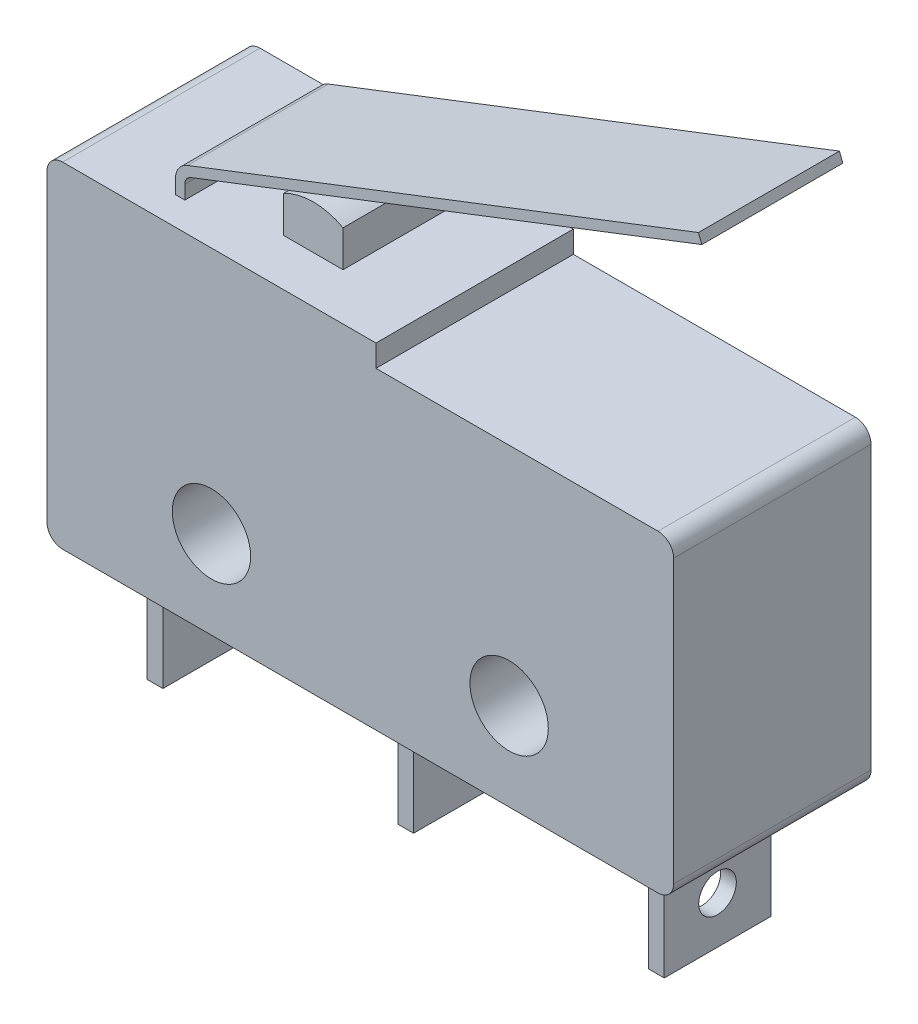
ISO-10303-21;
HEADER;
FILE_DESCRIPTION(('STEP AP214'),'2;1');
FILE_NAME('part.step','',(''),(''),'','','');
FILE_SCHEMA(('AUTOMOTIVE_DESIGN { 1 0 10303 214 1 1 1 1 }'));
ENDSEC;
DATA;
#1=APPLICATION_CONTEXT('core data for automotive mechanical design processes');
#2=APPLICATION_PROTOCOL_DEFINITION('international standard','automotive_design',2000,#1);
#3=PRODUCT_CONTEXT('',#1,'mechanical');
#4=PRODUCT('Part','Part','',(#3));
#5=PRODUCT_RELATED_PRODUCT_CATEGORY('part','',(#4));
#6=PRODUCT_DEFINITION_FORMATION('','',#4);
#7=PRODUCT_DEFINITION_CONTEXT('part definition',#1,'design');
#8=PRODUCT_DEFINITION('design','',#6,#7);
#9=PRODUCT_DEFINITION_SHAPE('','',#8);
#10=(LENGTH_UNIT() NAMED_UNIT(*) SI_UNIT(.MILLI.,.METRE.));
#11=(NAMED_UNIT(*) PLANE_ANGLE_UNIT() SI_UNIT($,.RADIAN.));
#12=(NAMED_UNIT(*) SI_UNIT($,.STERADIAN.) SOLID_ANGLE_UNIT());
#13=UNCERTAINTY_MEASURE_WITH_UNIT(LENGTH_MEASURE(1.E-05),#10,'distance_accuracy_value','');
#14=(GEOMETRIC_REPRESENTATION_CONTEXT(3) GLOBAL_UNCERTAINTY_ASSIGNED_CONTEXT((#13)) GLOBAL_UNIT_ASSIGNED_CONTEXT((#10,
#11,#12)) REPRESENTATION_CONTEXT('',''));
#15=CARTESIAN_POINT('',(0.,0.,0.));
#16=DIRECTION('',(0.,0.,1.));
#17=DIRECTION('',(1.,0.,0.));
#18=AXIS2_PLACEMENT_3D('',#15,#16,#17);
#19=CARTESIAN_POINT('',(0.,0.,2.25));
#20=DIRECTION('',(0.,0.,1.));
#21=DIRECTION('',(1.,0.,0.));
#22=AXIS2_PLACEMENT_3D('',#19,#20,#21);
#23=PLANE('',#22);
#24=DIRECTION('',(0.,1.,0.));
#25=VECTOR('',#24,1.);
#26=CARTESIAN_POINT('',(-6.8,0.,2.25));
#27=LINE('',#26,#25);
#28=CARTESIAN_POINT('',(-6.8,5.790311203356,2.25));
#29=VERTEX_POINT('',#28);
#30=CARTESIAN_POINT('',(-6.8,5.35,2.25));
#31=VERTEX_POINT('',#30);
#32=EDGE_CURVE('E227',#29,#31,#27,.F.);
#33=ORIENTED_EDGE('',*,*,#32,.T.);
#34=DIRECTION('',(1.,0.,0.));
#35=VECTOR('',#34,1.);
#36=CARTESIAN_POINT('',(0.,5.35,2.25));
#37=LINE('',#36,#35);
#38=CARTESIAN_POINT('',(-6.5,5.35,2.25));
#39=VERTEX_POINT('',#38);
#40=EDGE_CURVE('E202',#31,#39,#37,.T.);
#41=ORIENTED_EDGE('',*,*,#40,.T.);
#42=DIRECTION('',(0.,1.,0.));
#43=VECTOR('',#42,1.);
#44=CARTESIAN_POINT('',(-6.5,0.,2.25));
#45=LINE('',#44,#43);
#46=CARTESIAN_POINT('',(-6.5,5.790311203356,2.25));
#47=VERTEX_POINT('',#46);
#48=EDGE_CURVE('E196',#39,#47,#45,.T.);
#49=ORIENTED_EDGE('',*,*,#48,.T.);
#50=CARTESIAN_POINT('',(-6.2,5.790311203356,2.25));
#51=DIRECTION('',(0.,0.,1.));
#52=DIRECTION('',(1.,0.,0.));
#53=AXIS2_PLACEMENT_3D('',#50,#51,#52);
#54=CIRCLE('',#53,0.3);
#55=CARTESIAN_POINT('',(-6.30810695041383,6.07015560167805,2.25));
#56=VERTEX_POINT('',#55);
#57=EDGE_CURVE('E20',#47,#56,#54,.F.);
#58=ORIENTED_EDGE('',*,*,#57,.T.);
#59=DIRECTION('',(0.932814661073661,0.360356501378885,0.));
#60=VECTOR('',#59,1.);
#61=CARTESIAN_POINT('',(-6.308106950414,6.070155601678,2.25));
#62=LINE('',#61,#60);
#63=CARTESIAN_POINT('',(10.0000000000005,12.3701556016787,2.25));
#64=VERTEX_POINT('',#63);
#65=EDGE_CURVE('E355',#64,#56,#62,.F.);
#66=ORIENTED_EDGE('',*,*,#65,.F.);
#67=DIRECTION('',(-0.360356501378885,0.932814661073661,0.));
#68=VECTOR('',#67,1.);
#69=CARTESIAN_POINT('',(10.,12.37015560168,2.25));
#70=LINE('',#69,#68);
#71=CARTESIAN_POINT('',(9.89189304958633,12.6500000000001,2.25));
#72=VERTEX_POINT('',#71);
#73=EDGE_CURVE('E332',#72,#64,#70,.F.);
#74=ORIENTED_EDGE('',*,*,#73,.F.);
#75=DIRECTION('',(-0.932814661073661,-0.360356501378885,0.));
#76=VECTOR('',#75,1.);
#77=CARTESIAN_POINT('',(9.891893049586,12.65,2.25));
#78=LINE('',#77,#76);
#79=CARTESIAN_POINT('',(-6.41621390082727,6.35000000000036,2.25));
#80=VERTEX_POINT('',#79);
#81=EDGE_CURVE('E373',#80,#72,#78,.F.);
#82=ORIENTED_EDGE('',*,*,#81,.F.);
#83=CARTESIAN_POINT('',(-6.2,5.790311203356,2.25));
#84=DIRECTION('',(0.,0.,1.));
#85=DIRECTION('',(1.,0.,0.));
#86=AXIS2_PLACEMENT_3D('',#83,#84,#85);
#87=CIRCLE('',#86,0.6);
#88=EDGE_CURVE('E223',#80,#29,#87,.T.);
#89=ORIENTED_EDGE('',*,*,#88,.T.);
#90=EDGE_LOOP('',(#33,#41,#49,#58,#66,#74,#82,#89));
#91=FACE_BOUND('',#90,.T.);
#92=ADVANCED_FACE('F17',(#91),#23,.T.);
#93=CARTESIAN_POINT('',(10.,12.37015560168,-2.25));
#94=DIRECTION('',(0.932814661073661,0.360356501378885,0.));
#95=DIRECTION('',(-0.360356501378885,0.932814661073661,0.));
#96=AXIS2_PLACEMENT_3D('',#93,#94,#95);
#97=PLANE('',#96);
#98=DIRECTION('',(0.,0.,1.));
#99=VECTOR('',#98,1.);
#100=CARTESIAN_POINT('',(10.0000000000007,12.3701556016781,-2.25));
#101=LINE('',#100,#99);
#102=CARTESIAN_POINT('',(10.0000000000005,12.3701556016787,-2.25));
#103=VERTEX_POINT('',#102);
#104=EDGE_CURVE('E359',#103,#64,#101,.T.);
#105=ORIENTED_EDGE('',*,*,#104,.F.);
#106=DIRECTION('',(-0.360356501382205,0.932814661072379,0.));
#107=VECTOR('',#106,1.);
#108=CARTESIAN_POINT('',(10.,12.37015560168,-2.25));
#109=LINE('',#108,#107);
#110=CARTESIAN_POINT('',(9.891893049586,12.65,-2.25));
#111=VERTEX_POINT('',#110);
#112=EDGE_CURVE('E236',#103,#111,#109,.T.);
#113=ORIENTED_EDGE('',*,*,#112,.T.);
#114=DIRECTION('',(0.,0.,1.));
#115=VECTOR('',#114,1.);
#116=CARTESIAN_POINT('',(9.891893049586,12.65,-2.25));
#117=LINE('',#116,#115);
#118=EDGE_CURVE('E382',#72,#111,#117,.F.);
#119=ORIENTED_EDGE('',*,*,#118,.F.);
#120=ORIENTED_EDGE('',*,*,#73,.T.);
#121=EDGE_LOOP('',(#105,#113,#119,#120));
#122=FACE_BOUND('',#121,.T.);
#123=ADVANCED_FACE('F1098',(#122),#97,.T.);
#124=CARTESIAN_POINT('',(0.,0.,-2.25));
#125=DIRECTION('',(0.,0.,1.));
#126=DIRECTION('',(1.,0.,0.));
#127=AXIS2_PLACEMENT_3D('',#124,#125,#126);
#128=PLANE('',#127);
#129=CARTESIAN_POINT('',(-6.2,5.790311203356,-2.25));
#130=DIRECTION('',(0.,0.,1.));
#131=DIRECTION('',(1.,0.,0.));
#132=AXIS2_PLACEMENT_3D('',#129,#130,#131);
#133=CIRCLE('',#132,0.6);
#134=CARTESIAN_POINT('',(-6.41621390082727,6.35000000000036,-2.25));
#135=VERTEX_POINT('',#134);
#136=CARTESIAN_POINT('',(-6.8,5.790311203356,-2.25));
#137=VERTEX_POINT('',#136);
#138=EDGE_CURVE('E237',#135,#137,#133,.T.);
#139=ORIENTED_EDGE('',*,*,#138,.F.);
#140=DIRECTION('',(-0.932814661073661,-0.360356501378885,0.));
#141=VECTOR('',#140,1.);
#142=CARTESIAN_POINT('',(9.891893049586,12.65,-2.25));
#143=LINE('',#142,#141);
#144=EDGE_CURVE('E391',#111,#135,#143,.T.);
#145=ORIENTED_EDGE('',*,*,#144,.F.);
#146=ORIENTED_EDGE('',*,*,#112,.F.);
#147=DIRECTION('',(0.932814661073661,0.360356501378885,0.));
#148=VECTOR('',#147,1.);
#149=CARTESIAN_POINT('',(-6.308106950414,6.070155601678,-2.25));
#150=LINE('',#149,#148);
#151=CARTESIAN_POINT('',(-6.30810695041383,6.07015560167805,-2.25));
#152=VERTEX_POINT('',#151);
#153=EDGE_CURVE('E358',#152,#103,#150,.T.);
#154=ORIENTED_EDGE('',*,*,#153,.F.);
#155=CARTESIAN_POINT('',(-6.2,5.790311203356,-2.25));
#156=DIRECTION('',(0.,0.,1.));
#157=DIRECTION('',(1.,0.,0.));
#158=AXIS2_PLACEMENT_3D('',#155,#156,#157);
#159=CIRCLE('',#158,0.3);
#160=CARTESIAN_POINT('',(-6.5,5.790311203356,-2.25));
#161=VERTEX_POINT('',#160);
#162=EDGE_CURVE('E233',#161,#152,#159,.F.);
#163=ORIENTED_EDGE('',*,*,#162,.F.);
#164=DIRECTION('',(0.,1.,0.));
#165=VECTOR('',#164,1.);
#166=CARTESIAN_POINT('',(-6.5,0.,-2.25));
#167=LINE('',#166,#165);
#168=CARTESIAN_POINT('',(-6.5,5.35,-2.25));
#169=VERTEX_POINT('',#168);
#170=EDGE_CURVE('E212',#169,#161,#167,.T.);
#171=ORIENTED_EDGE('',*,*,#170,.F.);
#172=DIRECTION('',(1.,0.,0.));
#173=VECTOR('',#172,1.);
#174=CARTESIAN_POINT('',(0.,5.35,-2.25));
#175=LINE('',#174,#173);
#176=CARTESIAN_POINT('',(-6.8,5.35,-2.25));
#177=VERTEX_POINT('',#176);
#178=EDGE_CURVE('E341',#177,#169,#175,.T.);
#179=ORIENTED_EDGE('',*,*,#178,.F.);
#180=DIRECTION('',(0.,1.,0.));
#181=VECTOR('',#180,1.);
#182=CARTESIAN_POINT('',(-6.8,0.,-2.25));
#183=LINE('',#182,#181);
#184=EDGE_CURVE('E241',#137,#177,#183,.F.);
#185=ORIENTED_EDGE('',*,*,#184,.F.);
#186=EDGE_LOOP('',(#139,#145,#146,#154,#163,#171,#179,#185));
#187=FACE_BOUND('',#186,.T.);
#188=ADVANCED_FACE('F831',(#187),#128,.F.);
#189=CARTESIAN_POINT('',(-6.308106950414,6.070155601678,-2.25));
#190=DIRECTION('',(0.360356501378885,-0.932814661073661,0.));
#191=DIRECTION('',(0.932814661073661,0.360356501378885,0.));
#192=AXIS2_PLACEMENT_3D('',#189,#190,#191);
#193=PLANE('',#192);
#194=DIRECTION('',(0.,0.,1.));
#195=VECTOR('',#194,1.);
#196=CARTESIAN_POINT('',(-6.30810695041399,6.07015560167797,-2.25));
#197=LINE('',#196,#195);
#198=EDGE_CURVE('E221',#56,#152,#197,.F.);
#199=ORIENTED_EDGE('',*,*,#198,.T.);
#200=ORIENTED_EDGE('',*,*,#153,.T.);
#201=ORIENTED_EDGE('',*,*,#104,.T.);
#202=ORIENTED_EDGE('',*,*,#65,.T.);
#203=EDGE_LOOP('',(#199,#200,#201,#202));
#204=FACE_BOUND('',#203,.T.);
#205=ADVANCED_FACE('F827',(#204),#193,.T.);
#206=CARTESIAN_POINT('',(9.891893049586,12.65,-2.25));
#207=DIRECTION('',(-0.360356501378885,0.932814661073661,0.));
#208=DIRECTION('',(-0.932814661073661,-0.360356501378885,0.));
#209=AXIS2_PLACEMENT_3D('',#206,#207,#208);
#210=PLANE('',#209);
#211=ORIENTED_EDGE('',*,*,#118,.T.);
#212=ORIENTED_EDGE('',*,*,#144,.T.);
#213=DIRECTION('',(0.,0.,1.));
#214=VECTOR('',#213,1.);
#215=CARTESIAN_POINT('',(-6.41621390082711,6.35000000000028,-2.25));
#216=LINE('',#215,#214);
#217=EDGE_CURVE('E246',#80,#135,#216,.F.);
#218=ORIENTED_EDGE('',*,*,#217,.F.);
#219=ORIENTED_EDGE('',*,*,#81,.T.);
#220=EDGE_LOOP('',(#211,#212,#218,#219));
#221=FACE_BOUND('',#220,.T.);
#222=ADVANCED_FACE('F830',(#221),#210,.T.);
#223=CARTESIAN_POINT('',(-8.25,-5.35,-1.7));
#224=DIRECTION('',(0.,0.,-1.));
#225=DIRECTION('',(-1.,0.,0.));
#226=AXIS2_PLACEMENT_3D('',#223,#224,#225);
#227=PLANE('',#226);
#228=DIRECTION('',(0.,1.,0.));
#229=VECTOR('',#228,1.);
#230=CARTESIAN_POINT('',(-8.25,-5.35,-1.7));
#231=LINE('',#230,#229);
#232=CARTESIAN_POINT('',(-8.25,-5.35,-1.7));
#233=VERTEX_POINT('',#232);
#234=CARTESIAN_POINT('',(-8.25,-9.05,-1.7));
#235=VERTEX_POINT('',#234);
#236=EDGE_CURVE('E251',#233,#235,#231,.F.);
#237=ORIENTED_EDGE('',*,*,#236,.F.);
#238=DIRECTION('',(-1.,0.,0.));
#239=VECTOR('',#238,1.);
#240=CARTESIAN_POINT('',(-8.25,-5.35,-1.7));
#241=LINE('',#240,#239);
#242=CARTESIAN_POINT('',(-7.75,-5.35,-1.7));
#243=VERTEX_POINT('',#242);
#244=EDGE_CURVE('E402',#233,#243,#241,.F.);
#245=ORIENTED_EDGE('',*,*,#244,.T.);
#246=DIRECTION('',(0.,1.,0.));
#247=VECTOR('',#246,1.);
#248=CARTESIAN_POINT('',(-7.75,-5.35,-1.7));
#249=LINE('',#248,#247);
#250=CARTESIAN_POINT('',(-7.75,-9.05,-1.7));
#251=VERTEX_POINT('',#250);
#252=EDGE_CURVE('E252',#251,#243,#249,.T.);
#253=ORIENTED_EDGE('',*,*,#252,.F.);
#254=DIRECTION('',(1.,0.,0.));
#255=VECTOR('',#254,1.);
#256=CARTESIAN_POINT('',(0.,-9.05,-1.7));
#257=LINE('',#256,#255);
#258=EDGE_CURVE('E418',#235,#251,#257,.T.);
#259=ORIENTED_EDGE('',*,*,#258,.F.);
#260=EDGE_LOOP('',(#237,#245,#253,#259));
#261=FACE_BOUND('',#260,.T.);
#262=ADVANCED_FACE('F841',(#261),#227,.T.);
#263=CARTESIAN_POINT('',(0.,-9.05,0.));
#264=DIRECTION('',(0.,-1.,0.));
#265=DIRECTION('',(0.,0.,-1.));
#266=AXIS2_PLACEMENT_3D('',#263,#264,#265);
#267=PLANE('',#266);
#268=DIRECTION('',(1.,0.,0.));
#269=VECTOR('',#268,1.);
#270=CARTESIAN_POINT('',(-7.75,-9.05,1.7));
#271=LINE('',#270,#269);
#272=CARTESIAN_POINT('',(-8.25,-9.05,1.7));
#273=VERTEX_POINT('',#272);
#274=CARTESIAN_POINT('',(-7.75,-9.05,1.7));
#275=VERTEX_POINT('',#274);
#276=EDGE_CURVE('E422',#273,#275,#271,.T.);
#277=ORIENTED_EDGE('',*,*,#276,.F.);
#278=DIRECTION('',(0.,0.,1.));
#279=VECTOR('',#278,1.);
#280=CARTESIAN_POINT('',(-8.25,-9.05,1.7));
#281=LINE('',#280,#279);
#282=EDGE_CURVE('E520',#235,#273,#281,.T.);
#283=ORIENTED_EDGE('',*,*,#282,.F.);
#284=ORIENTED_EDGE('',*,*,#258,.T.);
#285=DIRECTION('',(0.,0.,-1.));
#286=VECTOR('',#285,1.);
#287=CARTESIAN_POINT('',(-7.75,-9.05,-1.7));
#288=LINE('',#287,#286);
#289=EDGE_CURVE('E510',#275,#251,#288,.T.);
#290=ORIENTED_EDGE('',*,*,#289,.F.);
#291=EDGE_LOOP('',(#277,#283,#284,#290));
#292=FACE_BOUND('',#291,.T.);
#293=ADVANCED_FACE('F965',(#292),#267,.T.);
#294=CARTESIAN_POINT('',(-7.75,-5.35,1.7));
#295=DIRECTION('',(0.,0.,1.));
#296=DIRECTION('',(1.,0.,0.));
#297=AXIS2_PLACEMENT_3D('',#294,#295,#296);
#298=PLANE('',#297);
#299=DIRECTION('',(0.,1.,0.));
#300=VECTOR('',#299,1.);
#301=CARTESIAN_POINT('',(-7.75,-5.35,1.7));
#302=LINE('',#301,#300);
#303=CARTESIAN_POINT('',(-7.75,-5.35,1.7));
#304=VERTEX_POINT('',#303);
#305=EDGE_CURVE('E245',#304,#275,#302,.F.);
#306=ORIENTED_EDGE('',*,*,#305,.F.);
#307=DIRECTION('',(1.,0.,0.));
#308=VECTOR('',#307,1.);
#309=CARTESIAN_POINT('',(-7.75,-5.35,1.7));
#310=LINE('',#309,#308);
#311=CARTESIAN_POINT('',(-8.25,-5.35,1.7));
#312=VERTEX_POINT('',#311);
#313=EDGE_CURVE('E426',#304,#312,#310,.F.);
#314=ORIENTED_EDGE('',*,*,#313,.T.);
#315=DIRECTION('',(0.,1.,0.));
#316=VECTOR('',#315,1.);
#317=CARTESIAN_POINT('',(-8.25,-5.35,1.7));
#318=LINE('',#317,#316);
#319=EDGE_CURVE('E258',#273,#312,#318,.T.);
#320=ORIENTED_EDGE('',*,*,#319,.F.);
#321=ORIENTED_EDGE('',*,*,#276,.T.);
#322=EDGE_LOOP('',(#306,#314,#320,#321));
#323=FACE_BOUND('',#322,.T.);
#324=ADVANCED_FACE('F969',(#323),#298,.T.);
#325=CARTESIAN_POINT('',(-8.25,-7.55,0.));
#326=DIRECTION('',(-1.,0.,0.));
#327=DIRECTION('',(0.,0.,1.));
#328=AXIS2_PLACEMENT_3D('',#325,#326,#327);
#329=CYLINDRICAL_SURFACE('',#328,0.6);
#330=CARTESIAN_POINT('',(-7.75,-7.55,0.));
#331=DIRECTION('',(-1.,0.,0.));
#332=DIRECTION('',(0.,0.,1.));
#333=AXIS2_PLACEMENT_3D('',#330,#331,#332);
#334=CIRCLE('',#333,0.6);
#335=CARTESIAN_POINT('',(-7.75,-7.55,0.6));
#336=VERTEX_POINT('',#335);
#337=EDGE_CURVE('E247',#336,#336,#334,.T.);
#338=ORIENTED_EDGE('',*,*,#337,.F.);
#339=EDGE_LOOP('',(#338));
#340=FACE_BOUND('',#339,.T.);
#341=CARTESIAN_POINT('',(-8.25,-7.55,0.));
#342=DIRECTION('',(-1.,0.,0.));
#343=DIRECTION('',(0.,0.,1.));
#344=AXIS2_PLACEMENT_3D('',#341,#342,#343);
#345=CIRCLE('',#344,0.6);
#346=CARTESIAN_POINT('',(-8.25,-7.55,0.6));
#347=VERTEX_POINT('',#346);
#348=EDGE_CURVE('E253',#347,#347,#345,.F.);
#349=ORIENTED_EDGE('',*,*,#348,.F.);
#350=EDGE_LOOP('',(#349));
#351=FACE_BOUND('',#350,.T.);
#352=ADVANCED_FACE('F890',(#340,#351),#329,.F.);
#353=CARTESIAN_POINT('',(-0.25,-5.35,-1.7));
#354=DIRECTION('',(0.,0.,-1.));
#355=DIRECTION('',(-1.,0.,0.));
#356=AXIS2_PLACEMENT_3D('',#353,#354,#355);
#357=PLANE('',#356);
#358=DIRECTION('',(0.,1.,0.));
#359=VECTOR('',#358,1.);
#360=CARTESIAN_POINT('',(-0.25,-5.35,-1.7));
#361=LINE('',#360,#359);
#362=CARTESIAN_POINT('',(-0.25,-5.35,-1.7));
#363=VERTEX_POINT('',#362);
#364=CARTESIAN_POINT('',(-0.25,-9.05,-1.7));
#365=VERTEX_POINT('',#364);
#366=EDGE_CURVE('E263',#363,#365,#361,.F.);
#367=ORIENTED_EDGE('',*,*,#366,.F.);
#368=DIRECTION('',(-1.,0.,0.));
#369=VECTOR('',#368,1.);
#370=CARTESIAN_POINT('',(-0.25,-5.35,-1.7));
#371=LINE('',#370,#369);
#372=CARTESIAN_POINT('',(0.25,-5.35,-1.7));
#373=VERTEX_POINT('',#372);
#374=EDGE_CURVE('E430',#363,#373,#371,.F.);
#375=ORIENTED_EDGE('',*,*,#374,.T.);
#376=DIRECTION('',(0.,1.,0.));
#377=VECTOR('',#376,1.);
#378=CARTESIAN_POINT('',(0.25,-5.35,-1.7));
#379=LINE('',#378,#377);
#380=CARTESIAN_POINT('',(0.25,-9.05,-1.7));
#381=VERTEX_POINT('',#380);
#382=EDGE_CURVE('E264',#381,#373,#379,.T.);
#383=ORIENTED_EDGE('',*,*,#382,.F.);
#384=DIRECTION('',(1.,0.,0.));
#385=VECTOR('',#384,1.);
#386=CARTESIAN_POINT('',(0.,-9.05,-1.7));
#387=LINE('',#386,#385);
#388=EDGE_CURVE('E434',#365,#381,#387,.T.);
#389=ORIENTED_EDGE('',*,*,#388,.F.);
#390=EDGE_LOOP('',(#367,#375,#383,#389));
#391=FACE_BOUND('',#390,.T.);
#392=ADVANCED_FACE('F868',(#391),#357,.T.);
#393=CARTESIAN_POINT('',(0.,-9.05,0.));
#394=DIRECTION('',(0.,-1.,0.));
#395=DIRECTION('',(0.,0.,-1.));
#396=AXIS2_PLACEMENT_3D('',#393,#394,#395);
#397=PLANE('',#396);
#398=DIRECTION('',(1.,0.,0.));
#399=VECTOR('',#398,1.);
#400=CARTESIAN_POINT('',(0.25,-9.05,1.7));
#401=LINE('',#400,#399);
#402=CARTESIAN_POINT('',(-0.25,-9.05,1.7));
#403=VERTEX_POINT('',#402);
#404=CARTESIAN_POINT('',(0.25,-9.05,1.7));
#405=VERTEX_POINT('',#404);
#406=EDGE_CURVE('E438',#403,#405,#401,.T.);
#407=ORIENTED_EDGE('',*,*,#406,.F.);
#408=DIRECTION('',(0.,0.,1.));
#409=VECTOR('',#408,1.);
#410=CARTESIAN_POINT('',(-0.25,-9.05,1.7));
#411=LINE('',#410,#409);
#412=EDGE_CURVE('E540',#365,#403,#411,.T.);
#413=ORIENTED_EDGE('',*,*,#412,.F.);
#414=ORIENTED_EDGE('',*,*,#388,.T.);
#415=DIRECTION('',(0.,0.,-1.));
#416=VECTOR('',#415,1.);
#417=CARTESIAN_POINT('',(0.25,-9.05,-1.7));
#418=LINE('',#417,#416);
#419=EDGE_CURVE('E530',#405,#381,#418,.T.);
#420=ORIENTED_EDGE('',*,*,#419,.F.);
#421=EDGE_LOOP('',(#407,#413,#414,#420));
#422=FACE_BOUND('',#421,.T.);
#423=ADVANCED_FACE('F863',(#422),#397,.T.);
#424=CARTESIAN_POINT('',(0.25,-5.35,1.7));
#425=DIRECTION('',(0.,0.,1.));
#426=DIRECTION('',(1.,0.,0.));
#427=AXIS2_PLACEMENT_3D('',#424,#425,#426);
#428=PLANE('',#427);
#429=DIRECTION('',(0.,1.,0.));
#430=VECTOR('',#429,1.);
#431=CARTESIAN_POINT('',(0.25,-5.35,1.7));
#432=LINE('',#431,#430);
#433=CARTESIAN_POINT('',(0.25,-5.35,1.7));
#434=VERTEX_POINT('',#433);
#435=EDGE_CURVE('E257',#434,#405,#432,.F.);
#436=ORIENTED_EDGE('',*,*,#435,.F.);
#437=DIRECTION('',(1.,0.,0.));
#438=VECTOR('',#437,1.);
#439=CARTESIAN_POINT('',(0.25,-5.35,1.7));
#440=LINE('',#439,#438);
#441=CARTESIAN_POINT('',(-0.25,-5.35,1.7));
#442=VERTEX_POINT('',#441);
#443=EDGE_CURVE('E442',#434,#442,#440,.F.);
#444=ORIENTED_EDGE('',*,*,#443,.T.);
#445=DIRECTION('',(0.,1.,0.));
#446=VECTOR('',#445,1.);
#447=CARTESIAN_POINT('',(-0.25,-5.35,1.7));
#448=LINE('',#447,#446);
#449=EDGE_CURVE('E270',#403,#442,#448,.T.);
#450=ORIENTED_EDGE('',*,*,#449,.F.);
#451=ORIENTED_EDGE('',*,*,#406,.T.);
#452=EDGE_LOOP('',(#436,#444,#450,#451));
#453=FACE_BOUND('',#452,.T.);
#454=ADVANCED_FACE('F867',(#453),#428,.T.);
#455=CARTESIAN_POINT('',(-8.25,-7.55,0.));
#456=DIRECTION('',(-1.,0.,0.));
#457=DIRECTION('',(0.,0.,1.));
#458=AXIS2_PLACEMENT_3D('',#455,#456,#457);
#459=CYLINDRICAL_SURFACE('',#458,0.6);
#460=CARTESIAN_POINT('',(0.25,-7.55,0.));
#461=DIRECTION('',(-1.,0.,0.));
#462=DIRECTION('',(0.,0.,1.));
#463=AXIS2_PLACEMENT_3D('',#460,#461,#462);
#464=CIRCLE('',#463,0.6);
#465=CARTESIAN_POINT('',(0.25,-7.55,0.6));
#466=VERTEX_POINT('',#465);
#467=EDGE_CURVE('E259',#466,#466,#464,.T.);
#468=ORIENTED_EDGE('',*,*,#467,.F.);
#469=EDGE_LOOP('',(#468));
#470=FACE_BOUND('',#469,.T.);
#471=CARTESIAN_POINT('',(-0.25,-7.55,0.));
#472=DIRECTION('',(-1.,0.,0.));
#473=DIRECTION('',(0.,0.,1.));
#474=AXIS2_PLACEMENT_3D('',#471,#472,#473);
#475=CIRCLE('',#474,0.6);
#476=CARTESIAN_POINT('',(-0.25,-7.55,0.6));
#477=VERTEX_POINT('',#476);
#478=EDGE_CURVE('E265',#477,#477,#475,.F.);
#479=ORIENTED_EDGE('',*,*,#478,.F.);
#480=EDGE_LOOP('',(#479));
#481=FACE_BOUND('',#480,.T.);
#482=ADVANCED_FACE('F878',(#470,#481),#459,.F.);
#483=CARTESIAN_POINT('',(7.75,-5.35,-1.7));
#484=DIRECTION('',(0.,0.,-1.));
#485=DIRECTION('',(-1.,0.,0.));
#486=AXIS2_PLACEMENT_3D('',#483,#484,#485);
#487=PLANE('',#486);
#488=DIRECTION('',(0.,1.,0.));
#489=VECTOR('',#488,1.);
#490=CARTESIAN_POINT('',(7.75,-5.35,-1.7));
#491=LINE('',#490,#489);
#492=CARTESIAN_POINT('',(7.75,-5.35,-1.7));
#493=VERTEX_POINT('',#492);
#494=CARTESIAN_POINT('',(7.75,-9.05,-1.7));
#495=VERTEX_POINT('',#494);
#496=EDGE_CURVE('E275',#493,#495,#491,.F.);
#497=ORIENTED_EDGE('',*,*,#496,.F.);
#498=DIRECTION('',(-1.,0.,0.));
#499=VECTOR('',#498,1.);
#500=CARTESIAN_POINT('',(7.75,-5.35,-1.7));
#501=LINE('',#500,#499);
#502=CARTESIAN_POINT('',(8.25,-5.35,-1.7));
#503=VERTEX_POINT('',#502);
#504=EDGE_CURVE('E446',#493,#503,#501,.F.);
#505=ORIENTED_EDGE('',*,*,#504,.T.);
#506=DIRECTION('',(0.,1.,0.));
#507=VECTOR('',#506,1.);
#508=CARTESIAN_POINT('',(8.25,-5.35,-1.7));
#509=LINE('',#508,#507);
#510=CARTESIAN_POINT('',(8.25,-9.05,-1.7));
#511=VERTEX_POINT('',#510);
#512=EDGE_CURVE('E276',#511,#503,#509,.T.);
#513=ORIENTED_EDGE('',*,*,#512,.F.);
#514=DIRECTION('',(1.,0.,0.));
#515=VECTOR('',#514,1.);
#516=CARTESIAN_POINT('',(0.,-9.05,-1.7));
#517=LINE('',#516,#515);
#518=EDGE_CURVE('E450',#495,#511,#517,.T.);
#519=ORIENTED_EDGE('',*,*,#518,.F.);
#520=EDGE_LOOP('',(#497,#505,#513,#519));
#521=FACE_BOUND('',#520,.T.);
#522=ADVANCED_FACE('F881',(#521),#487,.T.);
#523=CARTESIAN_POINT('',(0.,-9.05,0.));
#524=DIRECTION('',(0.,-1.,0.));
#525=DIRECTION('',(0.,0.,-1.));
#526=AXIS2_PLACEMENT_3D('',#523,#524,#525);
#527=PLANE('',#526);
#528=DIRECTION('',(0.,0.,-1.));
#529=VECTOR('',#528,1.);
#530=CARTESIAN_POINT('',(8.25,-9.05,-1.7));
#531=LINE('',#530,#529);
#532=CARTESIAN_POINT('',(8.25,-9.05,1.7));
#533=VERTEX_POINT('',#532);
#534=EDGE_CURVE('E550',#533,#511,#531,.T.);
#535=ORIENTED_EDGE('',*,*,#534,.F.);
#536=DIRECTION('',(1.,0.,0.));
#537=VECTOR('',#536,1.);
#538=CARTESIAN_POINT('',(8.25,-9.05,1.7));
#539=LINE('',#538,#537);
#540=CARTESIAN_POINT('',(7.75,-9.05,1.7));
#541=VERTEX_POINT('',#540);
#542=EDGE_CURVE('E454',#541,#533,#539,.T.);
#543=ORIENTED_EDGE('',*,*,#542,.F.);
#544=DIRECTION('',(0.,0.,1.));
#545=VECTOR('',#544,1.);
#546=CARTESIAN_POINT('',(7.75,-9.05,1.7));
#547=LINE('',#546,#545);
#548=EDGE_CURVE('E560',#495,#541,#547,.T.);
#549=ORIENTED_EDGE('',*,*,#548,.F.);
#550=ORIENTED_EDGE('',*,*,#518,.T.);
#551=EDGE_LOOP('',(#535,#543,#549,#550));
#552=FACE_BOUND('',#551,.T.);
#553=ADVANCED_FACE('F925',(#552),#527,.T.);
#554=CARTESIAN_POINT('',(8.25,-5.35,1.7));
#555=DIRECTION('',(0.,0.,1.));
#556=DIRECTION('',(1.,0.,0.));
#557=AXIS2_PLACEMENT_3D('',#554,#555,#556);
#558=PLANE('',#557);
#559=DIRECTION('',(0.,1.,0.));
#560=VECTOR('',#559,1.);
#561=CARTESIAN_POINT('',(8.25,-5.35,1.7));
#562=LINE('',#561,#560);
#563=CARTESIAN_POINT('',(8.25,-5.35,1.7));
#564=VERTEX_POINT('',#563);
#565=EDGE_CURVE('E269',#564,#533,#562,.F.);
#566=ORIENTED_EDGE('',*,*,#565,.F.);
#567=DIRECTION('',(1.,0.,0.));
#568=VECTOR('',#567,1.);
#569=CARTESIAN_POINT('',(8.25,-5.35,1.7));
#570=LINE('',#569,#568);
#571=CARTESIAN_POINT('',(7.75,-5.35,1.7));
#572=VERTEX_POINT('',#571);
#573=EDGE_CURVE('E367',#564,#572,#570,.F.);
#574=ORIENTED_EDGE('',*,*,#573,.T.);
#575=DIRECTION('',(0.,1.,0.));
#576=VECTOR('',#575,1.);
#577=CARTESIAN_POINT('',(7.75,-5.35,1.7));
#578=LINE('',#577,#576);
#579=EDGE_CURVE('E282',#541,#572,#578,.T.);
#580=ORIENTED_EDGE('',*,*,#579,.F.);
#581=ORIENTED_EDGE('',*,*,#542,.T.);
#582=EDGE_LOOP('',(#566,#574,#580,#581));
#583=FACE_BOUND('',#582,.T.);
#584=ADVANCED_FACE('F912',(#583),#558,.T.);
#585=CARTESIAN_POINT('',(-8.25,-7.55,0.));
#586=DIRECTION('',(-1.,0.,0.));
#587=DIRECTION('',(0.,0.,1.));
#588=AXIS2_PLACEMENT_3D('',#585,#586,#587);
#589=CYLINDRICAL_SURFACE('',#588,0.6);
#590=CARTESIAN_POINT('',(8.25,-7.55,0.));
#591=DIRECTION('',(-1.,0.,0.));
#592=DIRECTION('',(0.,0.,1.));
#593=AXIS2_PLACEMENT_3D('',#590,#591,#592);
#594=CIRCLE('',#593,0.6);
#595=CARTESIAN_POINT('',(8.25,-7.55,0.6));
#596=VERTEX_POINT('',#595);
#597=EDGE_CURVE('E271',#596,#596,#594,.T.);
#598=ORIENTED_EDGE('',*,*,#597,.F.);
#599=EDGE_LOOP('',(#598));
#600=FACE_BOUND('',#599,.T.);
#601=CARTESIAN_POINT('',(7.75,-7.55,0.));
#602=DIRECTION('',(-1.,0.,0.));
#603=DIRECTION('',(0.,0.,1.));
#604=AXIS2_PLACEMENT_3D('',#601,#602,#603);
#605=CIRCLE('',#604,0.6);
#606=CARTESIAN_POINT('',(7.75,-7.55,0.6));
#607=VERTEX_POINT('',#606);
#608=EDGE_CURVE('E277',#607,#607,#605,.F.);
#609=ORIENTED_EDGE('',*,*,#608,.F.);
#610=EDGE_LOOP('',(#609));
#611=FACE_BOUND('',#610,.T.);
#612=ADVANCED_FACE('F907',(#600,#611),#589,.F.);
#613=CARTESIAN_POINT('',(-3.,4.75,-1.65));
#614=DIRECTION('',(0.,0.,1.));
#615=DIRECTION('',(1.,0.,0.));
#616=AXIS2_PLACEMENT_3D('',#613,#614,#615);
#617=CYLINDRICAL_SURFACE('',#616,2.);
#618=DIRECTION('',(0.,0.,-1.));
#619=VECTOR('',#618,1.);
#620=CARTESIAN_POINT('',(-2.05,6.50997159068,-1.65));
#621=LINE('',#620,#619);
#622=CARTESIAN_POINT('',(-2.05,6.5099715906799,-1.65));
#623=VERTEX_POINT('',#622);
#624=CARTESIAN_POINT('',(-2.05,6.5099715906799,1.65));
#625=VERTEX_POINT('',#624);
#626=EDGE_CURVE('E481',#623,#625,#621,.F.);
#627=ORIENTED_EDGE('',*,*,#626,.F.);
#628=CARTESIAN_POINT('',(-3.,4.75,-1.65));
#629=DIRECTION('',(0.,0.,1.));
#630=DIRECTION('',(1.,0.,0.));
#631=AXIS2_PLACEMENT_3D('',#628,#629,#630);
#632=CIRCLE('',#631,2.);
#633=CARTESIAN_POINT('',(-3.95,6.5099715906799,-1.65));
#634=VERTEX_POINT('',#633);
#635=EDGE_CURVE('E296',#623,#634,#632,.T.);
#636=ORIENTED_EDGE('',*,*,#635,.T.);
#637=DIRECTION('',(0.,0.,1.));
#638=VECTOR('',#637,1.);
#639=CARTESIAN_POINT('',(-3.95,6.50997159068,-1.65));
#640=LINE('',#639,#638);
#641=CARTESIAN_POINT('',(-3.95,6.5099715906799,1.65));
#642=VERTEX_POINT('',#641);
#643=EDGE_CURVE('E474',#642,#634,#640,.F.);
#644=ORIENTED_EDGE('',*,*,#643,.F.);
#645=CARTESIAN_POINT('',(-3.,4.75,1.65));
#646=DIRECTION('',(0.,0.,1.));
#647=DIRECTION('',(1.,0.,0.));
#648=AXIS2_PLACEMENT_3D('',#645,#646,#647);
#649=CIRCLE('',#648,2.);
#650=EDGE_CURVE('E291',#625,#642,#649,.T.);
#651=ORIENTED_EDGE('',*,*,#650,.F.);
#652=EDGE_LOOP('',(#627,#636,#644,#651));
#653=FACE_BOUND('',#652,.T.);
#654=ADVANCED_FACE('F911',(#653),#617,.T.);
#655=CARTESIAN_POINT('',(-6.2,5.790311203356,-2.25));
#656=DIRECTION('',(0.,0.,1.));
#657=DIRECTION('',(1.,0.,0.));
#658=AXIS2_PLACEMENT_3D('',#655,#656,#657);
#659=CYLINDRICAL_SURFACE('',#658,0.3);
#660=ORIENTED_EDGE('',*,*,#57,.F.);
#661=DIRECTION('',(0.,0.,-1.));
#662=VECTOR('',#661,1.);
#663=CARTESIAN_POINT('',(-6.5,5.790311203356,-2.25));
#664=LINE('',#663,#662);
#665=EDGE_CURVE('E210',#161,#47,#664,.F.);
#666=ORIENTED_EDGE('',*,*,#665,.F.);
#667=ORIENTED_EDGE('',*,*,#162,.T.);
#668=ORIENTED_EDGE('',*,*,#198,.F.);
#669=EDGE_LOOP('',(#660,#666,#667,#668));
#670=FACE_BOUND('',#669,.T.);
#671=ADVANCED_FACE('F219',(#670),#659,.F.);
#672=CARTESIAN_POINT('',(-6.2,5.790311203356,-2.25));
#673=DIRECTION('',(0.,0.,1.));
#674=DIRECTION('',(1.,0.,0.));
#675=AXIS2_PLACEMENT_3D('',#672,#673,#674);
#676=CYLINDRICAL_SURFACE('',#675,0.6);
#677=ORIENTED_EDGE('',*,*,#217,.T.);
#678=ORIENTED_EDGE('',*,*,#138,.T.);
#679=DIRECTION('',(0.,0.,1.));
#680=VECTOR('',#679,1.);
#681=CARTESIAN_POINT('',(-6.8,5.790311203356,-2.25));
#682=LINE('',#681,#680);
#683=EDGE_CURVE('E215',#29,#137,#682,.F.);
#684=ORIENTED_EDGE('',*,*,#683,.F.);
#685=ORIENTED_EDGE('',*,*,#88,.F.);
#686=EDGE_LOOP('',(#677,#678,#684,#685));
#687=FACE_BOUND('',#686,.T.);
#688=ADVANCED_FACE('F1067',(#687),#676,.T.);
#689=CARTESIAN_POINT('',(-9.5,-4.85,-3.15));
#690=DIRECTION('',(0.,0.,1.));
#691=DIRECTION('',(1.,0.,0.));
#692=AXIS2_PLACEMENT_3D('',#689,#690,#691);
#693=CYLINDRICAL_SURFACE('',#692,0.5);
#694=DIRECTION('',(0.,0.,1.));
#695=VECTOR('',#694,1.);
#696=CARTESIAN_POINT('',(-10.,-4.85,-3.15));
#697=LINE('',#696,#695);
#698=CARTESIAN_POINT('',(-10.,-4.85,-3.15));
#699=VERTEX_POINT('',#698);
#700=CARTESIAN_POINT('',(-10.,-4.85,3.15));
#701=VERTEX_POINT('',#700);
#702=EDGE_CURVE('E314',#699,#701,#697,.T.);
#703=ORIENTED_EDGE('',*,*,#702,.F.);
#704=CARTESIAN_POINT('',(-9.5,-4.85,-3.15));
#705=DIRECTION('',(0.,0.,1.));
#706=DIRECTION('',(1.,0.,0.));
#707=AXIS2_PLACEMENT_3D('',#704,#705,#706);
#708=CIRCLE('',#707,0.5);
#709=CARTESIAN_POINT('',(-9.5,-5.35,-3.15));
#710=VERTEX_POINT('',#709);
#711=EDGE_CURVE('E242',#699,#710,#708,.T.);
#712=ORIENTED_EDGE('',*,*,#711,.T.);
#713=DIRECTION('',(0.,0.,-1.));
#714=VECTOR('',#713,1.);
#715=CARTESIAN_POINT('',(-9.5,-5.35,-3.15));
#716=LINE('',#715,#714);
#717=CARTESIAN_POINT('',(-9.5,-5.35,3.15));
#718=VERTEX_POINT('',#717);
#719=EDGE_CURVE('E505',#718,#710,#716,.T.);
#720=ORIENTED_EDGE('',*,*,#719,.F.);
#721=CARTESIAN_POINT('',(-9.5,-4.85,3.15));
#722=DIRECTION('',(0.,0.,1.));
#723=DIRECTION('',(1.,0.,0.));
#724=AXIS2_PLACEMENT_3D('',#721,#722,#723);
#725=CIRCLE('',#724,0.5);
#726=EDGE_CURVE('E301',#701,#718,#725,.T.);
#727=ORIENTED_EDGE('',*,*,#726,.F.);
#728=EDGE_LOOP('',(#703,#712,#720,#727));
#729=FACE_BOUND('',#728,.T.);
#730=ADVANCED_FACE('F734',(#729),#693,.T.);
#731=CARTESIAN_POINT('',(-7.75,-5.35,-1.7));
#732=DIRECTION('',(1.,0.,0.));
#733=DIRECTION('',(0.,0.,-1.));
#734=AXIS2_PLACEMENT_3D('',#731,#732,#733);
#735=PLANE('',#734);
#736=ORIENTED_EDGE('',*,*,#337,.T.);
#737=EDGE_LOOP('',(#736));
#738=FACE_BOUND('',#737,.T.);
#739=ORIENTED_EDGE('',*,*,#252,.T.);
#740=DIRECTION('',(0.,0.,-1.));
#741=VECTOR('',#740,1.);
#742=CARTESIAN_POINT('',(-7.75,-5.35,-3.15));
#743=LINE('',#742,#741);
#744=EDGE_CURVE('E622',#304,#243,#743,.T.);
#745=ORIENTED_EDGE('',*,*,#744,.F.);
#746=ORIENTED_EDGE('',*,*,#305,.T.);
#747=ORIENTED_EDGE('',*,*,#289,.T.);
#748=EDGE_LOOP('',(#739,#745,#746,#747));
#749=FACE_BOUND('',#748,.T.);
#750=ADVANCED_FACE('F956',(#738,#749),#735,.T.);
#751=CARTESIAN_POINT('',(-8.25,-5.35,1.7));
#752=DIRECTION('',(-1.,0.,0.));
#753=DIRECTION('',(0.,0.,1.));
#754=AXIS2_PLACEMENT_3D('',#751,#752,#753);
#755=PLANE('',#754);
#756=ORIENTED_EDGE('',*,*,#348,.T.);
#757=EDGE_LOOP('',(#756));
#758=FACE_BOUND('',#757,.T.);
#759=ORIENTED_EDGE('',*,*,#319,.T.);
#760=DIRECTION('',(0.,0.,-1.));
#761=VECTOR('',#760,1.);
#762=CARTESIAN_POINT('',(-8.25,-5.35,-3.15));
#763=LINE('',#762,#761);
#764=EDGE_CURVE('E626',#233,#312,#763,.F.);
#765=ORIENTED_EDGE('',*,*,#764,.F.);
#766=ORIENTED_EDGE('',*,*,#236,.T.);
#767=ORIENTED_EDGE('',*,*,#282,.T.);
#768=EDGE_LOOP('',(#759,#765,#766,#767));
#769=FACE_BOUND('',#768,.T.);
#770=ADVANCED_FACE('F950',(#758,#769),#755,.T.);
#771=CARTESIAN_POINT('',(0.25,-5.35,-1.7));
#772=DIRECTION('',(1.,0.,0.));
#773=DIRECTION('',(0.,0.,-1.));
#774=AXIS2_PLACEMENT_3D('',#771,#772,#773);
#775=PLANE('',#774);
#776=ORIENTED_EDGE('',*,*,#467,.T.);
#777=EDGE_LOOP('',(#776));
#778=FACE_BOUND('',#777,.T.);
#779=ORIENTED_EDGE('',*,*,#382,.T.);
#780=DIRECTION('',(0.,0.,-1.));
#781=VECTOR('',#780,1.);
#782=CARTESIAN_POINT('',(0.25,-5.35,-3.15));
#783=LINE('',#782,#781);
#784=EDGE_CURVE('E630',#434,#373,#783,.T.);
#785=ORIENTED_EDGE('',*,*,#784,.F.);
#786=ORIENTED_EDGE('',*,*,#435,.T.);
#787=ORIENTED_EDGE('',*,*,#419,.T.);
#788=EDGE_LOOP('',(#779,#785,#786,#787));
#789=FACE_BOUND('',#788,.T.);
#790=ADVANCED_FACE('F898',(#778,#789),#775,.T.);
#791=CARTESIAN_POINT('',(-0.25,-5.35,1.7));
#792=DIRECTION('',(-1.,0.,0.));
#793=DIRECTION('',(0.,0.,1.));
#794=AXIS2_PLACEMENT_3D('',#791,#792,#793);
#795=PLANE('',#794);
#796=ORIENTED_EDGE('',*,*,#478,.T.);
#797=EDGE_LOOP('',(#796));
#798=FACE_BOUND('',#797,.T.);
#799=ORIENTED_EDGE('',*,*,#449,.T.);
#800=DIRECTION('',(0.,0.,-1.));
#801=VECTOR('',#800,1.);
#802=CARTESIAN_POINT('',(-0.25,-5.35,-3.15));
#803=LINE('',#802,#801);
#804=EDGE_CURVE('E634',#363,#442,#803,.F.);
#805=ORIENTED_EDGE('',*,*,#804,.F.);
#806=ORIENTED_EDGE('',*,*,#366,.T.);
#807=ORIENTED_EDGE('',*,*,#412,.T.);
#808=EDGE_LOOP('',(#799,#805,#806,#807));
#809=FACE_BOUND('',#808,.T.);
#810=ADVANCED_FACE('F853',(#798,#809),#795,.T.);
#811=CARTESIAN_POINT('',(8.25,-5.35,-1.7));
#812=DIRECTION('',(1.,0.,0.));
#813=DIRECTION('',(0.,0.,-1.));
#814=AXIS2_PLACEMENT_3D('',#811,#812,#813);
#815=PLANE('',#814);
#816=ORIENTED_EDGE('',*,*,#597,.T.);
#817=EDGE_LOOP('',(#816));
#818=FACE_BOUND('',#817,.T.);
#819=ORIENTED_EDGE('',*,*,#512,.T.);
#820=DIRECTION('',(0.,0.,-1.));
#821=VECTOR('',#820,1.);
#822=CARTESIAN_POINT('',(8.25,-5.35,-3.15));
#823=LINE('',#822,#821);
#824=EDGE_CURVE('E638',#564,#503,#823,.T.);
#825=ORIENTED_EDGE('',*,*,#824,.F.);
#826=ORIENTED_EDGE('',*,*,#565,.T.);
#827=ORIENTED_EDGE('',*,*,#534,.T.);
#828=EDGE_LOOP('',(#819,#825,#826,#827));
#829=FACE_BOUND('',#828,.T.);
#830=ADVANCED_FACE('F848',(#818,#829),#815,.T.);
#831=CARTESIAN_POINT('',(7.75,-5.35,1.7));
#832=DIRECTION('',(-1.,0.,0.));
#833=DIRECTION('',(0.,0.,1.));
#834=AXIS2_PLACEMENT_3D('',#831,#832,#833);
#835=PLANE('',#834);
#836=ORIENTED_EDGE('',*,*,#608,.T.);
#837=EDGE_LOOP('',(#836));
#838=FACE_BOUND('',#837,.T.);
#839=ORIENTED_EDGE('',*,*,#579,.T.);
#840=DIRECTION('',(0.,0.,-1.));
#841=VECTOR('',#840,1.);
#842=CARTESIAN_POINT('',(7.75,-5.35,-3.15));
#843=LINE('',#842,#841);
#844=EDGE_CURVE('E642',#493,#572,#843,.F.);
#845=ORIENTED_EDGE('',*,*,#844,.F.);
#846=ORIENTED_EDGE('',*,*,#496,.T.);
#847=ORIENTED_EDGE('',*,*,#548,.T.);
#848=EDGE_LOOP('',(#839,#845,#846,#847));
#849=FACE_BOUND('',#848,.T.);
#850=ADVANCED_FACE('F852',(#838,#849),#835,.T.);
#851=CARTESIAN_POINT('',(9.5,-4.85,-3.15));
#852=DIRECTION('',(0.,0.,1.));
#853=DIRECTION('',(1.,0.,0.));
#854=AXIS2_PLACEMENT_3D('',#851,#852,#853);
#855=CYLINDRICAL_SURFACE('',#854,0.5);
#856=DIRECTION('',(0.,0.,-1.));
#857=VECTOR('',#856,1.);
#858=CARTESIAN_POINT('',(9.5,-5.35,-3.15));
#859=LINE('',#858,#857);
#860=CARTESIAN_POINT('',(9.5,-5.35,-3.15));
#861=VERTEX_POINT('',#860);
#862=CARTESIAN_POINT('',(9.5,-5.35,3.15));
#863=VERTEX_POINT('',#862);
#864=EDGE_CURVE('E506',#861,#863,#859,.F.);
#865=ORIENTED_EDGE('',*,*,#864,.F.);
#866=CARTESIAN_POINT('',(9.5,-4.85,-3.15));
#867=DIRECTION('',(0.,0.,1.));
#868=DIRECTION('',(1.,0.,0.));
#869=AXIS2_PLACEMENT_3D('',#866,#867,#868);
#870=CIRCLE('',#869,0.5);
#871=CARTESIAN_POINT('',(10.,-4.85,-3.15));
#872=VERTEX_POINT('',#871);
#873=EDGE_CURVE('E281',#861,#872,#870,.T.);
#874=ORIENTED_EDGE('',*,*,#873,.T.);
#875=DIRECTION('',(0.,0.,-1.));
#876=VECTOR('',#875,1.);
#877=CARTESIAN_POINT('',(10.,-4.85,-3.15));
#878=LINE('',#877,#876);
#879=CARTESIAN_POINT('',(10.,-4.85,3.15));
#880=VERTEX_POINT('',#879);
#881=EDGE_CURVE('E571',#880,#872,#878,.T.);
#882=ORIENTED_EDGE('',*,*,#881,.F.);
#883=CARTESIAN_POINT('',(9.5,-4.85,3.15));
#884=DIRECTION('',(0.,0.,1.));
#885=DIRECTION('',(1.,0.,0.));
#886=AXIS2_PLACEMENT_3D('',#883,#884,#885);
#887=CIRCLE('',#886,0.5);
#888=EDGE_CURVE('E304',#863,#880,#887,.T.);
#889=ORIENTED_EDGE('',*,*,#888,.F.);
#890=EDGE_LOOP('',(#865,#874,#882,#889));
#891=FACE_BOUND('',#890,.T.);
#892=ADVANCED_FACE('F726',(#891),#855,.T.);
#893=CARTESIAN_POINT('',(9.5,4.15,-3.15));
#894=DIRECTION('',(0.,0.,1.));
#895=DIRECTION('',(1.,0.,0.));
#896=AXIS2_PLACEMENT_3D('',#893,#894,#895);
#897=CYLINDRICAL_SURFACE('',#896,0.5);
#898=DIRECTION('',(0.,0.,-1.));
#899=VECTOR('',#898,1.);
#900=CARTESIAN_POINT('',(10.,4.15,-3.15));
#901=LINE('',#900,#899);
#902=CARTESIAN_POINT('',(10.,4.15,-3.15));
#903=VERTEX_POINT('',#902);
#904=CARTESIAN_POINT('',(10.,4.15,3.15));
#905=VERTEX_POINT('',#904);
#906=EDGE_CURVE('E572',#903,#905,#901,.F.);
#907=ORIENTED_EDGE('',*,*,#906,.F.);
#908=CARTESIAN_POINT('',(9.5,4.15,-3.15));
#909=DIRECTION('',(0.,0.,1.));
#910=DIRECTION('',(1.,0.,0.));
#911=AXIS2_PLACEMENT_3D('',#908,#909,#910);
#912=CIRCLE('',#911,0.5);
#913=CARTESIAN_POINT('',(9.5,4.65,-3.15));
#914=VERTEX_POINT('',#913);
#915=EDGE_CURVE('E285',#903,#914,#912,.T.);
#916=ORIENTED_EDGE('',*,*,#915,.T.);
#917=DIRECTION('',(0.,0.,1.));
#918=VECTOR('',#917,1.);
#919=CARTESIAN_POINT('',(9.5,4.65,-3.15));
#920=LINE('',#919,#918);
#921=CARTESIAN_POINT('',(9.5,4.65,3.15));
#922=VERTEX_POINT('',#921);
#923=EDGE_CURVE('E579',#922,#914,#920,.F.);
#924=ORIENTED_EDGE('',*,*,#923,.F.);
#925=CARTESIAN_POINT('',(9.5,4.15,3.15));
#926=DIRECTION('',(0.,0.,1.));
#927=DIRECTION('',(1.,0.,0.));
#928=AXIS2_PLACEMENT_3D('',#925,#926,#927);
#929=CIRCLE('',#928,0.5);
#930=EDGE_CURVE('E307',#905,#922,#929,.T.);
#931=ORIENTED_EDGE('',*,*,#930,.F.);
#932=EDGE_LOOP('',(#907,#916,#924,#931));
#933=FACE_BOUND('',#932,.T.);
#934=ADVANCED_FACE('F717',(#933),#897,.T.);
#935=CARTESIAN_POINT('',(-9.5,4.85,-3.15));
#936=DIRECTION('',(0.,0.,1.));
#937=DIRECTION('',(1.,0.,0.));
#938=AXIS2_PLACEMENT_3D('',#935,#936,#937);
#939=CYLINDRICAL_SURFACE('',#938,0.5);
#940=DIRECTION('',(0.,0.,1.));
#941=VECTOR('',#940,1.);
#942=CARTESIAN_POINT('',(-9.5,5.35,-3.15));
#943=LINE('',#942,#941);
#944=CARTESIAN_POINT('',(-9.5,5.35,-3.15));
#945=VERTEX_POINT('',#944);
#946=CARTESIAN_POINT('',(-9.5,5.35,3.15));
#947=VERTEX_POINT('',#946);
#948=EDGE_CURVE('E592',#945,#947,#943,.T.);
#949=ORIENTED_EDGE('',*,*,#948,.F.);
#950=CARTESIAN_POINT('',(-9.5,4.85,-3.15));
#951=DIRECTION('',(0.,0.,1.));
#952=DIRECTION('',(1.,0.,0.));
#953=AXIS2_PLACEMENT_3D('',#950,#951,#952);
#954=CIRCLE('',#953,0.5);
#955=CARTESIAN_POINT('',(-10.,4.85,-3.15));
#956=VERTEX_POINT('',#955);
#957=EDGE_CURVE('E288',#945,#956,#954,.T.);
#958=ORIENTED_EDGE('',*,*,#957,.T.);
#959=DIRECTION('',(0.,0.,1.));
#960=VECTOR('',#959,1.);
#961=CARTESIAN_POINT('',(-10.,4.85,-3.15));
#962=LINE('',#961,#960);
#963=CARTESIAN_POINT('',(-10.,4.85,3.15));
#964=VERTEX_POINT('',#963);
#965=EDGE_CURVE('E500',#964,#956,#962,.F.);
#966=ORIENTED_EDGE('',*,*,#965,.F.);
#967=CARTESIAN_POINT('',(-9.5,4.85,3.15));
#968=DIRECTION('',(0.,0.,1.));
#969=DIRECTION('',(1.,0.,0.));
#970=AXIS2_PLACEMENT_3D('',#967,#968,#969);
#971=CIRCLE('',#970,0.5);
#972=EDGE_CURVE('E311',#947,#964,#971,.T.);
#973=ORIENTED_EDGE('',*,*,#972,.F.);
#974=EDGE_LOOP('',(#949,#958,#966,#973));
#975=FACE_BOUND('',#974,.T.);
#976=ADVANCED_FACE('F697',(#975),#939,.T.);
#977=CARTESIAN_POINT('',(0.5,4.65,-3.15));
#978=DIRECTION('',(1.,0.,0.));
#979=DIRECTION('',(0.,0.,-1.));
#980=AXIS2_PLACEMENT_3D('',#977,#978,#979);
#981=PLANE('',#980);
#982=DIRECTION('',(0.,0.,1.));
#983=VECTOR('',#982,1.);
#984=CARTESIAN_POINT('',(0.5,4.65,-3.15));
#985=LINE('',#984,#983);
#986=CARTESIAN_POINT('',(0.5,4.65,-3.15));
#987=VERTEX_POINT('',#986);
#988=CARTESIAN_POINT('',(0.5,4.65,3.15));
#989=VERTEX_POINT('',#988);
#990=EDGE_CURVE('E580',#987,#989,#985,.T.);
#991=ORIENTED_EDGE('',*,*,#990,.F.);
#992=DIRECTION('',(0.,1.,0.));
#993=VECTOR('',#992,1.);
#994=CARTESIAN_POINT('',(0.5,4.65,-3.15));
#995=LINE('',#994,#993);
#996=CARTESIAN_POINT('',(0.5,5.35,-3.15));
#997=VERTEX_POINT('',#996);
#998=EDGE_CURVE('E40',#987,#997,#995,.T.);
#999=ORIENTED_EDGE('',*,*,#998,.T.);
#1000=DIRECTION('',(0.,0.,1.));
#1001=VECTOR('',#1000,1.);
#1002=CARTESIAN_POINT('',(0.5,5.35,-3.15));
#1003=LINE('',#1002,#1001);
#1004=CARTESIAN_POINT('',(0.5,5.35,3.15));
#1005=VERTEX_POINT('',#1004);
#1006=EDGE_CURVE('E480',#1005,#997,#1003,.F.);
#1007=ORIENTED_EDGE('',*,*,#1006,.F.);
#1008=DIRECTION('',(0.,1.,0.));
#1009=VECTOR('',#1008,1.);
#1010=CARTESIAN_POINT('',(0.5,0.,3.15));
#1011=LINE('',#1010,#1009);
#1012=EDGE_CURVE('E310',#989,#1005,#1011,.T.);
#1013=ORIENTED_EDGE('',*,*,#1012,.F.);
#1014=EDGE_LOOP('',(#991,#999,#1007,#1013));
#1015=FACE_BOUND('',#1014,.T.);
#1016=ADVANCED_FACE('F707',(#1015),#981,.T.);
#1017=CARTESIAN_POINT('',(-2.05,5.35,-1.65));
#1018=DIRECTION('',(1.,0.,0.));
#1019=DIRECTION('',(0.,0.,-1.));
#1020=AXIS2_PLACEMENT_3D('',#1017,#1018,#1019);
#1021=PLANE('',#1020);
#1022=DIRECTION('',(0.,1.,0.));
#1023=VECTOR('',#1022,1.);
#1024=CARTESIAN_POINT('',(-2.05,0.,1.65));
#1025=LINE('',#1024,#1023);
#1026=CARTESIAN_POINT('',(-2.05,5.35,1.65));
#1027=VERTEX_POINT('',#1026);
#1028=EDGE_CURVE('E295',#1027,#625,#1025,.T.);
#1029=ORIENTED_EDGE('',*,*,#1028,.F.);
#1030=DIRECTION('',(0.,0.,1.));
#1031=VECTOR('',#1030,1.);
#1032=CARTESIAN_POINT('',(-2.05,5.35,-3.15));
#1033=LINE('',#1032,#1031);
#1034=CARTESIAN_POINT('',(-2.05,5.35,-1.65));
#1035=VERTEX_POINT('',#1034);
#1036=EDGE_CURVE('E468',#1035,#1027,#1033,.T.);
#1037=ORIENTED_EDGE('',*,*,#1036,.F.);
#1038=DIRECTION('',(0.,1.,0.));
#1039=VECTOR('',#1038,1.);
#1040=CARTESIAN_POINT('',(-2.05,0.,-1.65));
#1041=LINE('',#1040,#1039);
#1042=EDGE_CURVE('E300',#1035,#623,#1041,.T.);
#1043=ORIENTED_EDGE('',*,*,#1042,.T.);
#1044=ORIENTED_EDGE('',*,*,#626,.T.);
#1045=EDGE_LOOP('',(#1029,#1037,#1043,#1044));
#1046=FACE_BOUND('',#1045,.T.);
#1047=ADVANCED_FACE('F821',(#1046),#1021,.T.);
#1048=CARTESIAN_POINT('',(0.,0.,1.65));
#1049=DIRECTION('',(0.,0.,1.));
#1050=DIRECTION('',(1.,0.,0.));
#1051=AXIS2_PLACEMENT_3D('',#1048,#1049,#1050);
#1052=PLANE('',#1051);
#1053=DIRECTION('',(0.,1.,0.));
#1054=VECTOR('',#1053,1.);
#1055=CARTESIAN_POINT('',(-3.95,6.50997159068,1.65));
#1056=LINE('',#1055,#1054);
#1057=CARTESIAN_POINT('',(-3.95,5.35,1.65));
#1058=VERTEX_POINT('',#1057);
#1059=EDGE_CURVE('E294',#1058,#642,#1056,.T.);
#1060=ORIENTED_EDGE('',*,*,#1059,.F.);
#1061=DIRECTION('',(1.,0.,0.));
#1062=VECTOR('',#1061,1.);
#1063=CARTESIAN_POINT('',(0.5,5.35,1.65));
#1064=LINE('',#1063,#1062);
#1065=EDGE_CURVE('E463',#1027,#1058,#1064,.F.);
#1066=ORIENTED_EDGE('',*,*,#1065,.F.);
#1067=ORIENTED_EDGE('',*,*,#1028,.T.);
#1068=ORIENTED_EDGE('',*,*,#650,.T.);
#1069=EDGE_LOOP('',(#1060,#1066,#1067,#1068));
#1070=FACE_BOUND('',#1069,.T.);
#1071=ADVANCED_FACE('F818',(#1070),#1052,.T.);
#1072=CARTESIAN_POINT('',(-3.95,6.50997159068,-1.65));
#1073=DIRECTION('',(-1.,0.,0.));
#1074=DIRECTION('',(0.,0.,1.));
#1075=AXIS2_PLACEMENT_3D('',#1072,#1073,#1074);
#1076=PLANE('',#1075);
#1077=DIRECTION('',(0.,1.,0.));
#1078=VECTOR('',#1077,1.);
#1079=CARTESIAN_POINT('',(-3.95,0.,-1.65));
#1080=LINE('',#1079,#1078);
#1081=CARTESIAN_POINT('',(-3.95,5.35,-1.65));
#1082=VERTEX_POINT('',#1081);
#1083=EDGE_CURVE('E216',#634,#1082,#1080,.F.);
#1084=ORIENTED_EDGE('',*,*,#1083,.T.);
#1085=DIRECTION('',(0.,0.,1.));
#1086=VECTOR('',#1085,1.);
#1087=CARTESIAN_POINT('',(-3.95,5.35,-3.15));
#1088=LINE('',#1087,#1086);
#1089=EDGE_CURVE('E467',#1058,#1082,#1088,.F.);
#1090=ORIENTED_EDGE('',*,*,#1089,.F.);
#1091=ORIENTED_EDGE('',*,*,#1059,.T.);
#1092=ORIENTED_EDGE('',*,*,#643,.T.);
#1093=EDGE_LOOP('',(#1084,#1090,#1091,#1092));
#1094=FACE_BOUND('',#1093,.T.);
#1095=ADVANCED_FACE('F811',(#1094),#1076,.T.);
#1096=CARTESIAN_POINT('',(0.,0.,-1.65));
#1097=DIRECTION('',(0.,0.,1.));
#1098=DIRECTION('',(1.,0.,0.));
#1099=AXIS2_PLACEMENT_3D('',#1096,#1097,#1098);
#1100=PLANE('',#1099);
#1101=ORIENTED_EDGE('',*,*,#635,.F.);
#1102=ORIENTED_EDGE('',*,*,#1042,.F.);
#1103=DIRECTION('',(1.,0.,0.));
#1104=VECTOR('',#1103,1.);
#1105=CARTESIAN_POINT('',(0.5,5.35,-1.65));
#1106=LINE('',#1105,#1104);
#1107=EDGE_CURVE('E337',#1082,#1035,#1106,.T.);
#1108=ORIENTED_EDGE('',*,*,#1107,.F.);
#1109=ORIENTED_EDGE('',*,*,#1083,.F.);
#1110=EDGE_LOOP('',(#1101,#1102,#1108,#1109));
#1111=FACE_BOUND('',#1110,.T.);
#1112=ADVANCED_FACE('F808',(#1111),#1100,.F.);
#1113=CARTESIAN_POINT('',(-6.5,5.35,-2.25));
#1114=DIRECTION('',(1.,0.,0.));
#1115=DIRECTION('',(0.,0.,-1.));
#1116=AXIS2_PLACEMENT_3D('',#1113,#1114,#1115);
#1117=PLANE('',#1116);
#1118=ORIENTED_EDGE('',*,*,#48,.F.);
#1119=DIRECTION('',(0.,0.,1.));
#1120=VECTOR('',#1119,1.);
#1121=CARTESIAN_POINT('',(-6.5,5.35,-3.15));
#1122=LINE('',#1121,#1120);
#1123=EDGE_CURVE('E335',#169,#39,#1122,.T.);
#1124=ORIENTED_EDGE('',*,*,#1123,.F.);
#1125=ORIENTED_EDGE('',*,*,#170,.T.);
#1126=ORIENTED_EDGE('',*,*,#665,.T.);
#1127=EDGE_LOOP('',(#1118,#1124,#1125,#1126));
#1128=FACE_BOUND('',#1127,.T.);
#1129=ADVANCED_FACE('F211',(#1128),#1117,.T.);
#1130=CARTESIAN_POINT('',(-6.8,5.790311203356,-2.25));
#1131=DIRECTION('',(-1.,0.,0.));
#1132=DIRECTION('',(0.,0.,1.));
#1133=AXIS2_PLACEMENT_3D('',#1130,#1131,#1132);
#1134=PLANE('',#1133);
#1135=ORIENTED_EDGE('',*,*,#184,.T.);
#1136=DIRECTION('',(0.,0.,1.));
#1137=VECTOR('',#1136,1.);
#1138=CARTESIAN_POINT('',(-6.8,5.35,-3.15));
#1139=LINE('',#1138,#1137);
#1140=EDGE_CURVE('E320',#31,#177,#1139,.F.);
#1141=ORIENTED_EDGE('',*,*,#1140,.F.);
#1142=ORIENTED_EDGE('',*,*,#32,.F.);
#1143=ORIENTED_EDGE('',*,*,#683,.T.);
#1144=EDGE_LOOP('',(#1135,#1141,#1142,#1143));
#1145=FACE_BOUND('',#1144,.T.);
#1146=ADVANCED_FACE('F748',(#1145),#1134,.T.);
#1147=CARTESIAN_POINT('',(0.,0.,3.15));
#1148=DIRECTION('',(0.,0.,1.));
#1149=DIRECTION('',(1.,0.,0.));
#1150=AXIS2_PLACEMENT_3D('',#1147,#1148,#1149);
#1151=PLANE('',#1150);
#1152=CARTESIAN_POINT('',(4.75,-2.55,3.15));
#1153=DIRECTION('',(0.,0.,1.));
#1154=DIRECTION('',(1.,0.,0.));
#1155=AXIS2_PLACEMENT_3D('',#1152,#1153,#1154);
#1156=CIRCLE('',#1155,1.25);
#1157=CARTESIAN_POINT('',(6.,-2.55,3.15));
#1158=VERTEX_POINT('',#1157);
#1159=EDGE_CURVE('E319',#1158,#1158,#1156,.F.);
#1160=ORIENTED_EDGE('',*,*,#1159,.T.);
#1161=EDGE_LOOP('',(#1160));
#1162=FACE_BOUND('',#1161,.T.);
#1163=CARTESIAN_POINT('',(-4.75,-2.55,3.15));
#1164=DIRECTION('',(0.,0.,1.));
#1165=DIRECTION('',(1.,0.,0.));
#1166=AXIS2_PLACEMENT_3D('',#1163,#1164,#1165);
#1167=CIRCLE('',#1166,1.25);
#1168=CARTESIAN_POINT('',(-3.5,-2.55,3.15));
#1169=VERTEX_POINT('',#1168);
#1170=EDGE_CURVE('E315',#1169,#1169,#1167,.F.);
#1171=ORIENTED_EDGE('',*,*,#1170,.T.);
#1172=EDGE_LOOP('',(#1171));
#1173=FACE_BOUND('',#1172,.T.);
#1174=DIRECTION('',(1.,0.,0.));
#1175=VECTOR('',#1174,1.);
#1176=CARTESIAN_POINT('',(0.5,5.35,3.15));
#1177=LINE('',#1176,#1175);
#1178=EDGE_CURVE('E588',#947,#1005,#1177,.T.);
#1179=ORIENTED_EDGE('',*,*,#1178,.F.);
#1180=ORIENTED_EDGE('',*,*,#972,.T.);
#1181=DIRECTION('',(0.,1.,0.));
#1182=VECTOR('',#1181,1.);
#1183=CARTESIAN_POINT('',(-10.,4.85,3.15));
#1184=LINE('',#1183,#1182);
#1185=EDGE_CURVE('E496',#701,#964,#1184,.T.);
#1186=ORIENTED_EDGE('',*,*,#1185,.F.);
#1187=ORIENTED_EDGE('',*,*,#726,.T.);
#1188=DIRECTION('',(1.,0.,0.));
#1189=VECTOR('',#1188,1.);
#1190=CARTESIAN_POINT('',(-9.5,-5.35,3.15));
#1191=LINE('',#1190,#1189);
#1192=EDGE_CURVE('E501',#863,#718,#1191,.F.);
#1193=ORIENTED_EDGE('',*,*,#1192,.F.);
#1194=ORIENTED_EDGE('',*,*,#888,.T.);
#1195=DIRECTION('',(0.,1.,0.));
#1196=VECTOR('',#1195,1.);
#1197=CARTESIAN_POINT('',(10.,-4.85,3.15));
#1198=LINE('',#1197,#1196);
#1199=EDGE_CURVE('E567',#905,#880,#1198,.F.);
#1200=ORIENTED_EDGE('',*,*,#1199,.F.);
#1201=ORIENTED_EDGE('',*,*,#930,.T.);
#1202=DIRECTION('',(1.,0.,0.));
#1203=VECTOR('',#1202,1.);
#1204=CARTESIAN_POINT('',(9.5,4.65,3.15));
#1205=LINE('',#1204,#1203);
#1206=EDGE_CURVE('E575',#989,#922,#1205,.T.);
#1207=ORIENTED_EDGE('',*,*,#1206,.F.);
#1208=ORIENTED_EDGE('',*,*,#1012,.T.);
#1209=EDGE_LOOP('',(#1179,#1180,#1186,#1187,#1193,#1194,#1200,#1201,#1207,#1208));
#1210=FACE_BOUND('',#1209,.T.);
#1211=ADVANCED_FACE('F701',(#1162,#1173,#1210),#1151,.T.);
#1212=CARTESIAN_POINT('',(-10.,4.85,-3.15));
#1213=DIRECTION('',(-1.,0.,0.));
#1214=DIRECTION('',(0.,0.,1.));
#1215=AXIS2_PLACEMENT_3D('',#1212,#1213,#1214);
#1216=PLANE('',#1215);
#1217=ORIENTED_EDGE('',*,*,#965,.T.);
#1218=DIRECTION('',(0.,1.,0.));
#1219=VECTOR('',#1218,1.);
#1220=CARTESIAN_POINT('',(-10.,0.,-3.15));
#1221=LINE('',#1220,#1219);
#1222=EDGE_CURVE('E324',#956,#699,#1221,.F.);
#1223=ORIENTED_EDGE('',*,*,#1222,.T.);
#1224=ORIENTED_EDGE('',*,*,#702,.T.);
#1225=ORIENTED_EDGE('',*,*,#1185,.T.);
#1226=EDGE_LOOP('',(#1217,#1223,#1224,#1225));
#1227=FACE_BOUND('',#1226,.T.);
#1228=ADVANCED_FACE('F736',(#1227),#1216,.T.);
#1229=CARTESIAN_POINT('',(-9.5,-5.35,-3.15));
#1230=DIRECTION('',(0.,-1.,0.));
#1231=DIRECTION('',(0.,0.,-1.));
#1232=AXIS2_PLACEMENT_3D('',#1229,#1230,#1231);
#1233=PLANE('',#1232);
#1234=ORIENTED_EDGE('',*,*,#844,.T.);
#1235=ORIENTED_EDGE('',*,*,#573,.F.);
#1236=ORIENTED_EDGE('',*,*,#824,.T.);
#1237=ORIENTED_EDGE('',*,*,#504,.F.);
#1238=EDGE_LOOP('',(#1234,#1235,#1236,#1237));
#1239=FACE_BOUND('',#1238,.T.);
#1240=ORIENTED_EDGE('',*,*,#374,.F.);
#1241=ORIENTED_EDGE('',*,*,#804,.T.);
#1242=ORIENTED_EDGE('',*,*,#443,.F.);
#1243=ORIENTED_EDGE('',*,*,#784,.T.);
#1244=EDGE_LOOP('',(#1240,#1241,#1242,#1243));
#1245=FACE_BOUND('',#1244,.T.);
#1246=ORIENTED_EDGE('',*,*,#244,.F.);
#1247=ORIENTED_EDGE('',*,*,#764,.T.);
#1248=ORIENTED_EDGE('',*,*,#313,.F.);
#1249=ORIENTED_EDGE('',*,*,#744,.T.);
#1250=EDGE_LOOP('',(#1246,#1247,#1248,#1249));
#1251=FACE_BOUND('',#1250,.T.);
#1252=ORIENTED_EDGE('',*,*,#719,.T.);
#1253=DIRECTION('',(1.,0.,0.));
#1254=VECTOR('',#1253,1.);
#1255=CARTESIAN_POINT('',(0.,-5.35,-3.15));
#1256=LINE('',#1255,#1254);
#1257=EDGE_CURVE('E668',#710,#861,#1256,.T.);
#1258=ORIENTED_EDGE('',*,*,#1257,.T.);
#1259=ORIENTED_EDGE('',*,*,#864,.T.);
#1260=ORIENTED_EDGE('',*,*,#1192,.T.);
#1261=EDGE_LOOP('',(#1252,#1258,#1259,#1260));
#1262=FACE_BOUND('',#1261,.T.);
#1263=ADVANCED_FACE('F729',(#1239,#1245,#1251,#1262),#1233,.T.);
#1264=CARTESIAN_POINT('',(10.,-4.85,-3.15));
#1265=DIRECTION('',(1.,0.,0.));
#1266=DIRECTION('',(0.,0.,-1.));
#1267=AXIS2_PLACEMENT_3D('',#1264,#1265,#1266);
#1268=PLANE('',#1267);
#1269=ORIENTED_EDGE('',*,*,#881,.T.);
#1270=DIRECTION('',(0.,1.,0.));
#1271=VECTOR('',#1270,1.);
#1272=CARTESIAN_POINT('',(10.,0.,-3.15));
#1273=LINE('',#1272,#1271);
#1274=EDGE_CURVE('E672',#872,#903,#1273,.T.);
#1275=ORIENTED_EDGE('',*,*,#1274,.T.);
#1276=ORIENTED_EDGE('',*,*,#906,.T.);
#1277=ORIENTED_EDGE('',*,*,#1199,.T.);
#1278=EDGE_LOOP('',(#1269,#1275,#1276,#1277));
#1279=FACE_BOUND('',#1278,.T.);
#1280=ADVANCED_FACE('F722',(#1279),#1268,.T.);
#1281=CARTESIAN_POINT('',(9.5,4.65,-3.15));
#1282=DIRECTION('',(0.,1.,0.));
#1283=DIRECTION('',(0.,0.,1.));
#1284=AXIS2_PLACEMENT_3D('',#1281,#1282,#1283);
#1285=PLANE('',#1284);
#1286=ORIENTED_EDGE('',*,*,#923,.T.);
#1287=DIRECTION('',(1.,0.,0.));
#1288=VECTOR('',#1287,1.);
#1289=CARTESIAN_POINT('',(0.,4.65,-3.15));
#1290=LINE('',#1289,#1288);
#1291=EDGE_CURVE('E676',#914,#987,#1290,.F.);
#1292=ORIENTED_EDGE('',*,*,#1291,.T.);
#1293=ORIENTED_EDGE('',*,*,#990,.T.);
#1294=ORIENTED_EDGE('',*,*,#1206,.T.);
#1295=EDGE_LOOP('',(#1286,#1292,#1293,#1294));
#1296=FACE_BOUND('',#1295,.T.);
#1297=ADVANCED_FACE('F714',(#1296),#1285,.T.);
#1298=CARTESIAN_POINT('',(0.5,5.35,-3.15));
#1299=DIRECTION('',(0.,1.,0.));
#1300=DIRECTION('',(0.,0.,1.));
#1301=AXIS2_PLACEMENT_3D('',#1298,#1299,#1300);
#1302=PLANE('',#1301);
#1303=ORIENTED_EDGE('',*,*,#1140,.T.);
#1304=ORIENTED_EDGE('',*,*,#178,.T.);
#1305=ORIENTED_EDGE('',*,*,#1123,.T.);
#1306=ORIENTED_EDGE('',*,*,#40,.F.);
#1307=EDGE_LOOP('',(#1303,#1304,#1305,#1306));
#1308=FACE_BOUND('',#1307,.T.);
#1309=ORIENTED_EDGE('',*,*,#1089,.T.);
#1310=ORIENTED_EDGE('',*,*,#1107,.T.);
#1311=ORIENTED_EDGE('',*,*,#1036,.T.);
#1312=ORIENTED_EDGE('',*,*,#1065,.T.);
#1313=EDGE_LOOP('',(#1309,#1310,#1311,#1312));
#1314=FACE_BOUND('',#1313,.T.);
#1315=ORIENTED_EDGE('',*,*,#1006,.T.);
#1316=DIRECTION('',(1.,0.,0.));
#1317=VECTOR('',#1316,1.);
#1318=CARTESIAN_POINT('',(0.,5.35,-3.15));
#1319=LINE('',#1318,#1317);
#1320=EDGE_CURVE('E327',#997,#945,#1319,.F.);
#1321=ORIENTED_EDGE('',*,*,#1320,.T.);
#1322=ORIENTED_EDGE('',*,*,#948,.T.);
#1323=ORIENTED_EDGE('',*,*,#1178,.T.);
#1324=EDGE_LOOP('',(#1315,#1321,#1322,#1323));
#1325=FACE_BOUND('',#1324,.T.);
#1326=ADVANCED_FACE('F688',(#1308,#1314,#1325),#1302,.T.);
#1327=CARTESIAN_POINT('',(-4.75,-2.55,3.15));
#1328=DIRECTION('',(0.,0.,1.));
#1329=DIRECTION('',(1.,0.,0.));
#1330=AXIS2_PLACEMENT_3D('',#1327,#1328,#1329);
#1331=CYLINDRICAL_SURFACE('',#1330,1.25);
#1332=ORIENTED_EDGE('',*,*,#1170,.F.);
#1333=EDGE_LOOP('',(#1332));
#1334=FACE_BOUND('',#1333,.T.);
#1335=CARTESIAN_POINT('',(-4.75,-2.55,-3.15));
#1336=DIRECTION('',(0.,0.,1.));
#1337=DIRECTION('',(1.,0.,0.));
#1338=AXIS2_PLACEMENT_3D('',#1335,#1336,#1337);
#1339=CIRCLE('',#1338,1.25);
#1340=CARTESIAN_POINT('',(-3.5,-2.55,-3.15));
#1341=VERTEX_POINT('',#1340);
#1342=EDGE_CURVE('E27',#1341,#1341,#1339,.F.);
#1343=ORIENTED_EDGE('',*,*,#1342,.T.);
#1344=EDGE_LOOP('',(#1343));
#1345=FACE_BOUND('',#1344,.T.);
#1346=ADVANCED_FACE('F758',(#1334,#1345),#1331,.F.);
#1347=CARTESIAN_POINT('',(4.75,-2.55,3.15));
#1348=DIRECTION('',(0.,0.,1.));
#1349=DIRECTION('',(1.,0.,0.));
#1350=AXIS2_PLACEMENT_3D('',#1347,#1348,#1349);
#1351=CYLINDRICAL_SURFACE('',#1350,1.25);
#1352=ORIENTED_EDGE('',*,*,#1159,.F.);
#1353=EDGE_LOOP('',(#1352));
#1354=FACE_BOUND('',#1353,.T.);
#1355=CARTESIAN_POINT('',(4.75,-2.55,-3.15));
#1356=DIRECTION('',(0.,0.,1.));
#1357=DIRECTION('',(1.,0.,0.));
#1358=AXIS2_PLACEMENT_3D('',#1355,#1356,#1357);
#1359=CIRCLE('',#1358,1.25);
#1360=CARTESIAN_POINT('',(6.,-2.55,-3.15));
#1361=VERTEX_POINT('',#1360);
#1362=EDGE_CURVE('E11',#1361,#1361,#1359,.F.);
#1363=ORIENTED_EDGE('',*,*,#1362,.T.);
#1364=EDGE_LOOP('',(#1363));
#1365=FACE_BOUND('',#1364,.T.);
#1366=ADVANCED_FACE('F752',(#1354,#1365),#1351,.F.);
#1367=CARTESIAN_POINT('',(0.,0.,-3.15));
#1368=DIRECTION('',(0.,0.,1.));
#1369=DIRECTION('',(1.,0.,0.));
#1370=AXIS2_PLACEMENT_3D('',#1367,#1368,#1369);
#1371=PLANE('',#1370);
#1372=ORIENTED_EDGE('',*,*,#1362,.F.);
#1373=EDGE_LOOP('',(#1372));
#1374=FACE_BOUND('',#1373,.T.);
#1375=ORIENTED_EDGE('',*,*,#1342,.F.);
#1376=EDGE_LOOP('',(#1375));
#1377=FACE_BOUND('',#1376,.T.);
#1378=ORIENTED_EDGE('',*,*,#998,.F.);
#1379=ORIENTED_EDGE('',*,*,#1291,.F.);
#1380=ORIENTED_EDGE('',*,*,#915,.F.);
#1381=ORIENTED_EDGE('',*,*,#1274,.F.);
#1382=ORIENTED_EDGE('',*,*,#873,.F.);
#1383=ORIENTED_EDGE('',*,*,#1257,.F.);
#1384=ORIENTED_EDGE('',*,*,#711,.F.);
#1385=ORIENTED_EDGE('',*,*,#1222,.F.);
#1386=ORIENTED_EDGE('',*,*,#957,.F.);
#1387=ORIENTED_EDGE('',*,*,#1320,.F.);
#1388=EDGE_LOOP('',(#1378,#1379,#1380,#1381,#1382,#1383,#1384,#1385,#1386,#1387));
#1389=FACE_BOUND('',#1388,.T.);
#1390=ADVANCED_FACE('F692',(#1374,#1377,#1389),#1371,.F.);
#1391=CLOSED_SHELL('',(#92,#123,#188,#205,#222,#262,#293,#324,#352,#392,#423,#454,#482,#522,
#553,#584,#612,#654,#671,#688,#730,#750,#770,#790,#810,#830,#850,#892,#934,#976,#1016,#1047,
#1071,#1095,#1112,#1129,#1146,#1211,#1228,#1263,#1280,#1297,#1326,#1346,#1366,#1390));
#1392=MANIFOLD_SOLID_BREP('B1',#1391);
#1393=ADVANCED_BREP_SHAPE_REPRESENTATION('',(#18,#1392),#14);
#1394=SHAPE_DEFINITION_REPRESENTATION(#9,#1393);
ENDSEC;
END-ISO-10303-21;
